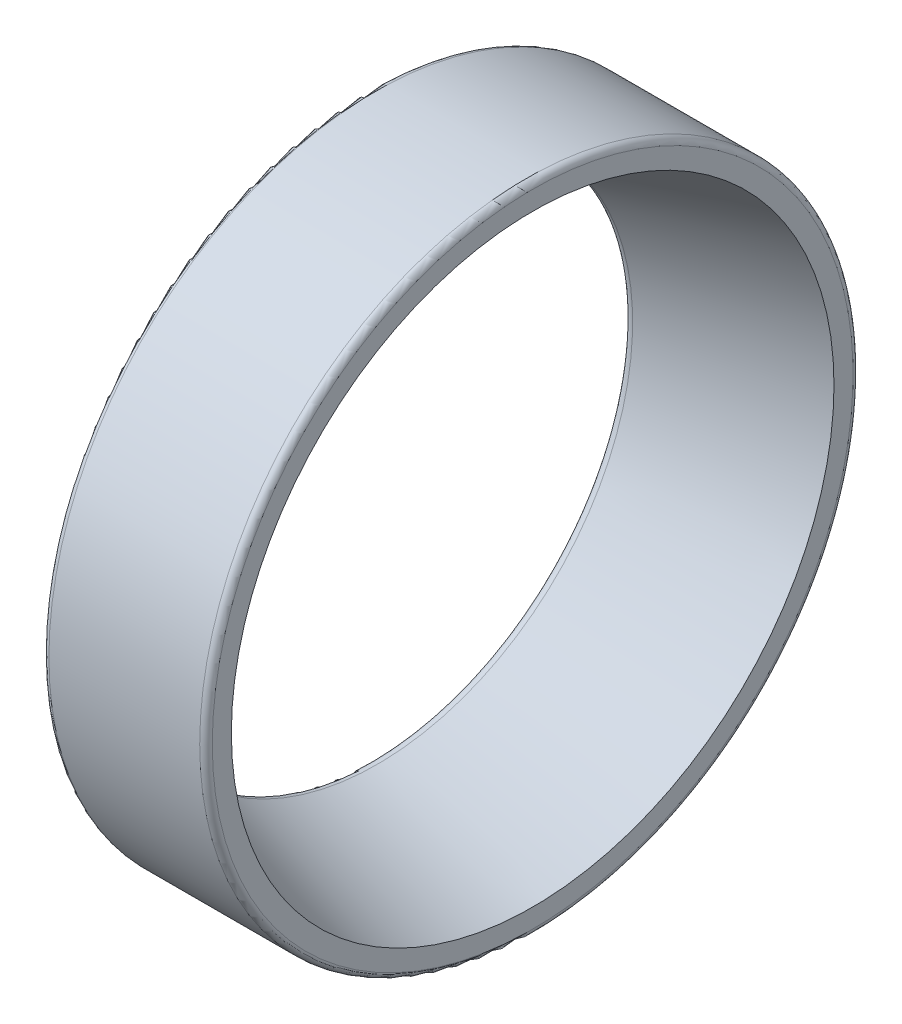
from build123d import *


with BuildPart() as part:
    # Esquisse1 → Base-R_volution (revolve)
    with BuildSketch(Plane(origin=(0, 0, 0), x_dir=(1, 0, 0), z_dir=(0, 1, 0)), mode=Mode.PRIVATE) as base_r_volution_sk:
        with BuildLine():
            Line((0, 20.797341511), (0, 25.5))
            ThreePointArc((0, 25.5), (0.146446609, 25.853553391), (0.5, 26))
            Line((0.5, 26), (12.5, 26))
            ThreePointArc((12.5, 26), (12.853553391, 25.853553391), (13, 25.5))
            Line((13, 25.5), (13, 23.980835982))
            Line((13, 23.980835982), (11.423120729, 23.51344955))
            Line((11.423120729, 23.51344955), (0.881782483, 20.389000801))
            Line((0.881782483, 20.389000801), (0.642089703, 20.31795595))
            ThreePointArc((0.642089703, 20.31795595), (0.200871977, 20.396689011), (0, 20.797341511))
        make_face()
    revolve(base_r_volution_sk.sketch.rotate(Axis((0, 0, 0), (1, 0, 0)), 180), axis=Axis((0, 0, 0), (1, 0, 0)))


solid = part.part
